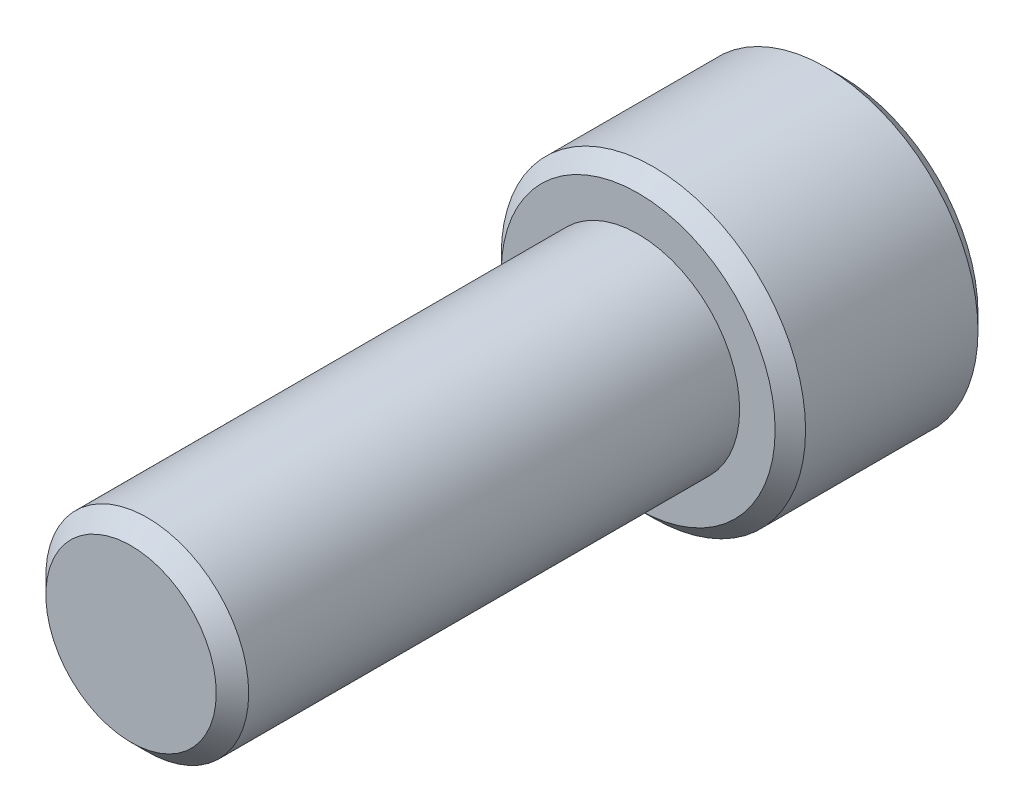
from build123d import *

# Parameters (mm, degrees)
SKETCH1_R          = 3.175
EXTRUDE1_DEPTH     = 15.875
SKETCH6_R          = 4.7625
EXTRUDE2_DEPTH     = 6.35
CUT_EXTRUDE1_DEPTH = 3.571875
CHAMFER1_SIZE      = 0.47625
CHAMFER2_SIZE      = 0.508


with BuildPart() as part:
    # Sketch1 → Extrude1 (new body)
    with BuildSketch(Plane.XY):
        Circle(SKETCH1_R)
    extrude(amount=-EXTRUDE1_DEPTH)

    # Sketch6 → Extrude2 (add)
    with BuildSketch(Plane(origin=(0, 0, -15.875), x_dir=(-1, 0, 0), z_dir=(0, 0, -1))):
        Circle(SKETCH6_R)
    extrude(amount=EXTRUDE2_DEPTH)

    # Sketch7 → Cut-Extrude1 (cut)
    with BuildSketch(Plane(origin=(0, 0, -22.225), x_dir=(-1, 0, 0), z_dir=(0, 0, -1))):
        Polygon((0, 2.749630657), (-2.38125, 1.374815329), (-2.38125, -1.374815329), (0, -2.749630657), (2.38125, -1.374815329), (2.38125, 1.374815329), align=None)
    extrude(amount=-CUT_EXTRUDE1_DEPTH, mode=Mode.SUBTRACT)

    # Cut-Extrude2 cone 1 section (on through the dimple's axis) → Cut-Extrude2 (revolve, cut)
    with BuildSketch(Plane(origin=(0, 0, -22.225), x_dir=(0, 1, 0), z_dir=(1, 0, 0))):
        Polygon((0, 0), (2.749630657, 0), (0, 2.749630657), align=None)
    revolve(axis=Axis((0, 0, -22.225), (0, 0, 1)), mode=Mode.SUBTRACT)

    # Chamfer1
    chamfer1_edges = [part.edges().sort_by_distance(p)[0] for p in [
        (4.7625, 0, -15.875),
        (4.7625, 0, -22.225),
    ]]
    chamfer(chamfer1_edges, length=CHAMFER1_SIZE)

    # Chamfer2
    chamfer2_edges = [part.edges().sort_by_distance(p)[0] for p in [
        (-3.175, 0, 0),
    ]]
    chamfer(chamfer2_edges, length=CHAMFER2_SIZE)


solid = part.part
